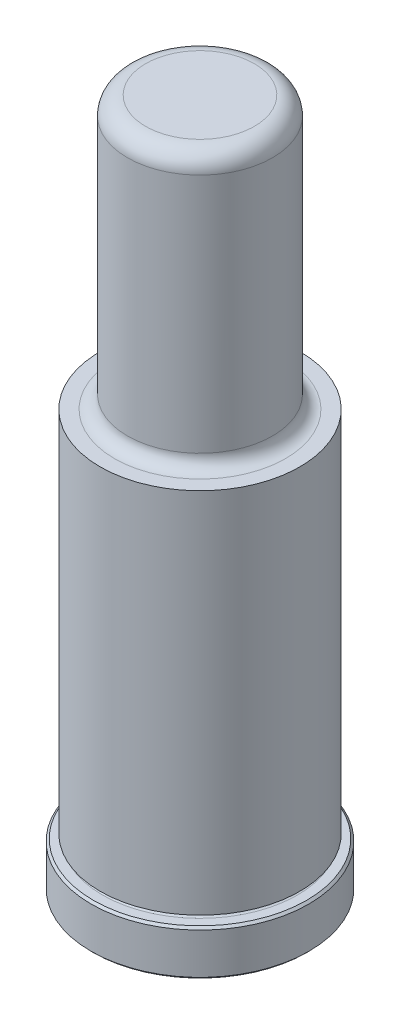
ISO-10303-21;
HEADER;
FILE_DESCRIPTION(('STEP AP214'),'2;1');
FILE_NAME('part.step','',(''),(''),'','','');
FILE_SCHEMA(('AUTOMOTIVE_DESIGN { 1 0 10303 214 1 1 1 1 }'));
ENDSEC;
DATA;
#1=APPLICATION_CONTEXT('core data for automotive mechanical design processes');
#2=APPLICATION_PROTOCOL_DEFINITION('international standard','automotive_design',2000,#1);
#3=PRODUCT_CONTEXT('',#1,'mechanical');
#4=PRODUCT('Part','Part','',(#3));
#5=PRODUCT_RELATED_PRODUCT_CATEGORY('part','',(#4));
#6=PRODUCT_DEFINITION_FORMATION('','',#4);
#7=PRODUCT_DEFINITION_CONTEXT('part definition',#1,'design');
#8=PRODUCT_DEFINITION('design','',#6,#7);
#9=PRODUCT_DEFINITION_SHAPE('','',#8);
#10=(LENGTH_UNIT() NAMED_UNIT(*) SI_UNIT(.MILLI.,.METRE.));
#11=(NAMED_UNIT(*) PLANE_ANGLE_UNIT() SI_UNIT($,.RADIAN.));
#12=(NAMED_UNIT(*) SI_UNIT($,.STERADIAN.) SOLID_ANGLE_UNIT());
#13=UNCERTAINTY_MEASURE_WITH_UNIT(LENGTH_MEASURE(1.E-05),#10,'distance_accuracy_value','');
#14=(GEOMETRIC_REPRESENTATION_CONTEXT(3) GLOBAL_UNCERTAINTY_ASSIGNED_CONTEXT((#13)) GLOBAL_UNIT_ASSIGNED_CONTEXT((#10,
#11,#12)) REPRESENTATION_CONTEXT('',''));
#15=CARTESIAN_POINT('',(0.,0.,0.));
#16=DIRECTION('',(0.,0.,1.));
#17=DIRECTION('',(1.,0.,0.));
#18=AXIS2_PLACEMENT_3D('',#15,#16,#17);
#19=CARTESIAN_POINT('',(0.,0.,0.));
#20=DIRECTION('',(0.,1.,0.));
#21=DIRECTION('',(0.,0.,1.));
#22=AXIS2_PLACEMENT_3D('',#19,#20,#21);
#23=PLANE('',#22);
#24=CARTESIAN_POINT('',(0.,0.,0.));
#25=DIRECTION('',(0.,1.,0.));
#26=DIRECTION('',(0.,0.,1.));
#27=AXIS2_PLACEMENT_3D('',#24,#25,#26);
#28=CIRCLE('',#27,18.669);
#29=CARTESIAN_POINT('',(0.,0.,18.669));
#30=VERTEX_POINT('',#29);
#31=EDGE_CURVE('E46',#30,#30,#28,.F.);
#32=ORIENTED_EDGE('',*,*,#31,.T.);
#33=EDGE_LOOP('',(#32));
#34=FACE_BOUND('',#33,.T.);
#35=ADVANCED_FACE('F31',(#34),#23,.F.);
#36=CARTESIAN_POINT('',(0.,0.,0.));
#37=DIRECTION('',(0.,1.,0.));
#38=DIRECTION('',(0.,0.,1.));
#39=AXIS2_PLACEMENT_3D('',#36,#37,#38);
#40=CYLINDRICAL_SURFACE('',#39,19.05);
#41=CARTESIAN_POINT('',(0.,0.380999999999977,0.));
#42=DIRECTION('',(0.,1.,0.));
#43=DIRECTION('',(0.,0.,1.));
#44=AXIS2_PLACEMENT_3D('',#41,#42,#43);
#45=CIRCLE('',#44,19.05);
#46=CARTESIAN_POINT('',(0.,0.380999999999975,19.05));
#47=VERTEX_POINT('',#46);
#48=EDGE_CURVE('E51',#47,#47,#45,.T.);
#49=ORIENTED_EDGE('',*,*,#48,.T.);
#50=EDGE_LOOP('',(#49));
#51=FACE_BOUND('',#50,.T.);
#52=CARTESIAN_POINT('',(0.,7.54380000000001,0.));
#53=DIRECTION('',(0.,-1.,0.));
#54=DIRECTION('',(0.,0.,-1.));
#55=AXIS2_PLACEMENT_3D('',#52,#53,#54);
#56=CIRCLE('',#55,19.05);
#57=CARTESIAN_POINT('',(0.,7.54380000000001,-19.05));
#58=VERTEX_POINT('',#57);
#59=EDGE_CURVE('E54',#58,#58,#56,.T.);
#60=ORIENTED_EDGE('',*,*,#59,.T.);
#61=EDGE_LOOP('',(#60));
#62=FACE_BOUND('',#61,.T.);
#63=ADVANCED_FACE('F110',(#51,#62),#40,.T.);
#64=CARTESIAN_POINT('',(0.,7.9248,-19.05));
#65=DIRECTION('',(0.,-1.,0.));
#66=DIRECTION('',(0.,0.,-1.));
#67=AXIS2_PLACEMENT_3D('',#64,#65,#66);
#68=PLANE('',#67);
#69=CARTESIAN_POINT('',(0.,7.9248,0.));
#70=DIRECTION('',(0.,-1.,0.));
#71=DIRECTION('',(0.,0.,-1.));
#72=AXIS2_PLACEMENT_3D('',#69,#70,#71);
#73=CIRCLE('',#72,18.669);
#74=CARTESIAN_POINT('',(0.,7.9248,-18.669));
#75=VERTEX_POINT('',#74);
#76=EDGE_CURVE('E42',#75,#75,#73,.F.);
#77=ORIENTED_EDGE('',*,*,#76,.T.);
#78=EDGE_LOOP('',(#77));
#79=FACE_BOUND('',#78,.T.);
#80=CARTESIAN_POINT('',(0.,7.9248,0.));
#81=DIRECTION('',(0.,1.,0.));
#82=DIRECTION('',(0.,0.,1.));
#83=AXIS2_PLACEMENT_3D('',#80,#81,#82);
#84=CIRCLE('',#83,17.0688);
#85=CARTESIAN_POINT('',(0.,7.92479999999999,17.0688));
#86=VERTEX_POINT('',#85);
#87=EDGE_CURVE('E57',#86,#86,#84,.T.);
#88=ORIENTED_EDGE('',*,*,#87,.F.);
#89=EDGE_LOOP('',(#88));
#90=FACE_BOUND('',#89,.T.);
#91=ADVANCED_FACE('F105',(#79,#90),#68,.F.);
#92=CARTESIAN_POINT('',(0.,8.3058,0.));
#93=DIRECTION('',(0.,1.,0.));
#94=DIRECTION('',(0.,0.,1.));
#95=AXIS2_PLACEMENT_3D('',#92,#93,#94);
#96=TOROIDAL_SURFACE('',#95,17.0688,0.381000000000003);
#97=CARTESIAN_POINT('',(0.,8.6868,0.));
#98=DIRECTION('',(0.,1.,0.));
#99=DIRECTION('',(0.,0.,1.));
#100=AXIS2_PLACEMENT_3D('',#97,#98,#99);
#101=CIRCLE('',#100,17.0688);
#102=CARTESIAN_POINT('',(0.,8.6868,17.0688));
#103=VERTEX_POINT('',#102);
#104=EDGE_CURVE('E60',#103,#103,#101,.T.);
#105=ORIENTED_EDGE('',*,*,#104,.F.);
#106=EDGE_LOOP('',(#105));
#107=FACE_BOUND('',#106,.T.);
#108=ORIENTED_EDGE('',*,*,#87,.T.);
#109=EDGE_LOOP('',(#108));
#110=FACE_BOUND('',#109,.T.);
#111=ADVANCED_FACE('F99',(#107,#110),#96,.F.);
#112=CARTESIAN_POINT('',(0.,8.6868,-17.0688));
#113=DIRECTION('',(0.,1.,0.));
#114=DIRECTION('',(0.,0.,1.));
#115=AXIS2_PLACEMENT_3D('',#112,#113,#114);
#116=PLANE('',#115);
#117=CARTESIAN_POINT('',(0.,8.6868,0.));
#118=DIRECTION('',(0.,1.,0.));
#119=DIRECTION('',(0.,0.,1.));
#120=AXIS2_PLACEMENT_3D('',#117,#118,#119);
#121=CIRCLE('',#120,17.4752);
#122=CARTESIAN_POINT('',(0.,8.6868,17.4752));
#123=VERTEX_POINT('',#122);
#124=EDGE_CURVE('E63',#123,#123,#121,.T.);
#125=ORIENTED_EDGE('',*,*,#124,.F.);
#126=EDGE_LOOP('',(#125));
#127=FACE_BOUND('',#126,.T.);
#128=ORIENTED_EDGE('',*,*,#104,.T.);
#129=EDGE_LOOP('',(#128));
#130=FACE_BOUND('',#129,.T.);
#131=ADVANCED_FACE('F93',(#127,#130),#116,.F.);
#132=CARTESIAN_POINT('',(0.,0.,0.));
#133=DIRECTION('',(0.,1.,0.));
#134=DIRECTION('',(0.,0.,1.));
#135=AXIS2_PLACEMENT_3D('',#132,#133,#134);
#136=CYLINDRICAL_SURFACE('',#135,17.4752);
#137=CARTESIAN_POINT('',(0.,73.025,0.));
#138=DIRECTION('',(0.,1.,0.));
#139=DIRECTION('',(0.,0.,1.));
#140=AXIS2_PLACEMENT_3D('',#137,#138,#139);
#141=CIRCLE('',#140,17.4752);
#142=CARTESIAN_POINT('',(0.,73.025,17.4752));
#143=VERTEX_POINT('',#142);
#144=EDGE_CURVE('E66',#143,#143,#141,.T.);
#145=ORIENTED_EDGE('',*,*,#144,.F.);
#146=EDGE_LOOP('',(#145));
#147=FACE_BOUND('',#146,.T.);
#148=ORIENTED_EDGE('',*,*,#124,.T.);
#149=EDGE_LOOP('',(#148));
#150=FACE_BOUND('',#149,.T.);
#151=ADVANCED_FACE('F87',(#147,#150),#136,.T.);
#152=CARTESIAN_POINT('',(0.,73.025,-17.4752));
#153=DIRECTION('',(0.,-1.,0.));
#154=DIRECTION('',(0.,0.,-1.));
#155=AXIS2_PLACEMENT_3D('',#152,#153,#154);
#156=PLANE('',#155);
#157=CARTESIAN_POINT('',(0.,73.025,0.));
#158=DIRECTION('',(0.,1.,0.));
#159=DIRECTION('',(0.,0.,1.));
#160=AXIS2_PLACEMENT_3D('',#157,#158,#159);
#161=CIRCLE('',#160,14.9733);
#162=CARTESIAN_POINT('',(0.,73.025,14.9733));
#163=VERTEX_POINT('',#162);
#164=EDGE_CURVE('E69',#163,#163,#161,.T.);
#165=ORIENTED_EDGE('',*,*,#164,.F.);
#166=EDGE_LOOP('',(#165));
#167=FACE_BOUND('',#166,.T.);
#168=ORIENTED_EDGE('',*,*,#144,.T.);
#169=EDGE_LOOP('',(#168));
#170=FACE_BOUND('',#169,.T.);
#171=ADVANCED_FACE('F81',(#167,#170),#156,.F.);
#172=CARTESIAN_POINT('',(0.,75.311,0.));
#173=DIRECTION('',(0.,1.,0.));
#174=DIRECTION('',(0.,0.,1.));
#175=AXIS2_PLACEMENT_3D('',#172,#173,#174);
#176=TOROIDAL_SURFACE('',#175,14.9733,2.286);
#177=CARTESIAN_POINT('',(0.,75.311,0.));
#178=DIRECTION('',(0.,1.,0.));
#179=DIRECTION('',(0.,0.,1.));
#180=AXIS2_PLACEMENT_3D('',#177,#178,#179);
#181=CIRCLE('',#180,12.6873);
#182=CARTESIAN_POINT('',(0.,75.311,12.6873));
#183=VERTEX_POINT('',#182);
#184=EDGE_CURVE('E72',#183,#183,#181,.T.);
#185=ORIENTED_EDGE('',*,*,#184,.F.);
#186=EDGE_LOOP('',(#185));
#187=FACE_BOUND('',#186,.T.);
#188=ORIENTED_EDGE('',*,*,#164,.T.);
#189=EDGE_LOOP('',(#188));
#190=FACE_BOUND('',#189,.T.);
#191=ADVANCED_FACE('F78',(#187,#190),#176,.F.);
#192=CARTESIAN_POINT('',(0.,0.,0.));
#193=DIRECTION('',(0.,1.,0.));
#194=DIRECTION('',(0.,0.,1.));
#195=AXIS2_PLACEMENT_3D('',#192,#193,#194);
#196=CYLINDRICAL_SURFACE('',#195,12.6873);
#197=CARTESIAN_POINT('',(0.,117.475,0.));
#198=DIRECTION('',(0.,-1.,0.));
#199=DIRECTION('',(0.,0.,-1.));
#200=AXIS2_PLACEMENT_3D('',#197,#198,#199);
#201=CIRCLE('',#200,12.6873);
#202=CARTESIAN_POINT('',(0.,117.475,-12.6873));
#203=VERTEX_POINT('',#202);
#204=EDGE_CURVE('E10',#203,#203,#201,.T.);
#205=ORIENTED_EDGE('',*,*,#204,.T.);
#206=EDGE_LOOP('',(#205));
#207=FACE_BOUND('',#206,.T.);
#208=ORIENTED_EDGE('',*,*,#184,.T.);
#209=EDGE_LOOP('',(#208));
#210=FACE_BOUND('',#209,.T.);
#211=ADVANCED_FACE('F76',(#207,#210),#196,.T.);
#212=CARTESIAN_POINT('',(0.,120.65,-12.6873));
#213=DIRECTION('',(0.,-1.,0.));
#214=DIRECTION('',(0.,0.,-1.));
#215=AXIS2_PLACEMENT_3D('',#212,#213,#214);
#216=PLANE('',#215);
#217=CARTESIAN_POINT('',(0.,120.65,0.));
#218=DIRECTION('',(0.,-1.,0.));
#219=DIRECTION('',(0.,0.,-1.));
#220=AXIS2_PLACEMENT_3D('',#217,#218,#219);
#221=CIRCLE('',#220,9.51230000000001);
#222=CARTESIAN_POINT('',(0.,120.65,-9.51229999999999));
#223=VERTEX_POINT('',#222);
#224=EDGE_CURVE('E38',#223,#223,#221,.F.);
#225=ORIENTED_EDGE('',*,*,#224,.T.);
#226=EDGE_LOOP('',(#225));
#227=FACE_BOUND('',#226,.T.);
#228=ADVANCED_FACE('F127',(#227),#216,.F.);
#229=CARTESIAN_POINT('',(0.,0.380999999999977,0.));
#230=DIRECTION('',(0.,1.,0.));
#231=DIRECTION('',(0.,0.,1.));
#232=AXIS2_PLACEMENT_3D('',#229,#230,#231);
#233=CONICAL_SURFACE('',#232,19.05,0.785398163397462);
#234=ORIENTED_EDGE('',*,*,#31,.F.);
#235=EDGE_LOOP('',(#234));
#236=FACE_BOUND('',#235,.T.);
#237=ORIENTED_EDGE('',*,*,#48,.F.);
#238=EDGE_LOOP('',(#237));
#239=FACE_BOUND('',#238,.T.);
#240=ADVANCED_FACE('F124',(#236,#239),#233,.T.);
#241=CARTESIAN_POINT('',(0.,7.9248,0.));
#242=DIRECTION('',(0.,-1.,0.));
#243=DIRECTION('',(0.,0.,-1.));
#244=AXIS2_PLACEMENT_3D('',#241,#242,#243);
#245=CONICAL_SURFACE('',#244,18.669,0.785398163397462);
#246=ORIENTED_EDGE('',*,*,#59,.F.);
#247=EDGE_LOOP('',(#246));
#248=FACE_BOUND('',#247,.T.);
#249=ORIENTED_EDGE('',*,*,#76,.F.);
#250=EDGE_LOOP('',(#249));
#251=FACE_BOUND('',#250,.T.);
#252=ADVANCED_FACE('F126',(#248,#251),#245,.T.);
#253=CARTESIAN_POINT('',(0.,117.475,0.));
#254=DIRECTION('',(0.,-1.,0.));
#255=DIRECTION('',(0.,0.,-1.));
#256=AXIS2_PLACEMENT_3D('',#253,#254,#255);
#257=TOROIDAL_SURFACE('',#256,9.51230000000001,3.175);
#258=ORIENTED_EDGE('',*,*,#204,.F.);
#259=EDGE_LOOP('',(#258));
#260=FACE_BOUND('',#259,.T.);
#261=ORIENTED_EDGE('',*,*,#224,.F.);
#262=EDGE_LOOP('',(#261));
#263=FACE_BOUND('',#262,.T.);
#264=ADVANCED_FACE('F33',(#260,#263),#257,.T.);
#265=CLOSED_SHELL('',(#35,#63,#91,#111,#131,#151,#171,#191,#211,#228,#240,#252,#264));
#266=MANIFOLD_SOLID_BREP('B2',#265);
#267=ADVANCED_BREP_SHAPE_REPRESENTATION('',(#18,#266),#14);
#268=SHAPE_DEFINITION_REPRESENTATION(#9,#267);
ENDSEC;
END-ISO-10303-21;
